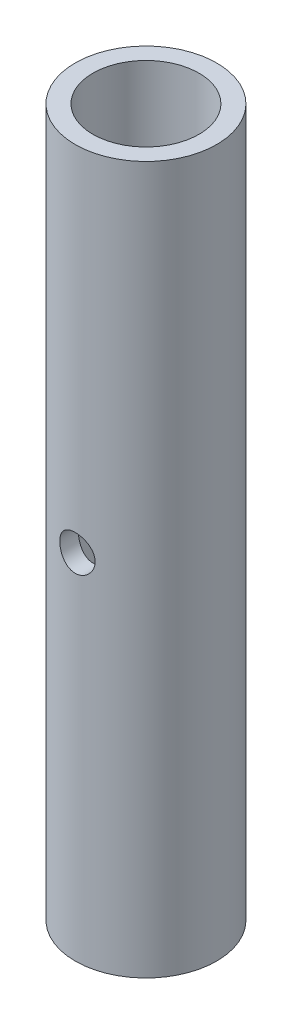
ISO-10303-21;
HEADER;
FILE_DESCRIPTION(('STEP AP214'),'2;1');
FILE_NAME('part.step','',(''),(''),'','','');
FILE_SCHEMA(('AUTOMOTIVE_DESIGN { 1 0 10303 214 1 1 1 1 }'));
ENDSEC;
DATA;
#1=APPLICATION_CONTEXT('core data for automotive mechanical design processes');
#2=APPLICATION_PROTOCOL_DEFINITION('international standard','automotive_design',2000,#1);
#3=PRODUCT_CONTEXT('',#1,'mechanical');
#4=PRODUCT('Part','Part','',(#3));
#5=PRODUCT_RELATED_PRODUCT_CATEGORY('part','',(#4));
#6=PRODUCT_DEFINITION_FORMATION('','',#4);
#7=PRODUCT_DEFINITION_CONTEXT('part definition',#1,'design');
#8=PRODUCT_DEFINITION('design','',#6,#7);
#9=PRODUCT_DEFINITION_SHAPE('','',#8);
#10=(LENGTH_UNIT() NAMED_UNIT(*) SI_UNIT(.MILLI.,.METRE.));
#11=(NAMED_UNIT(*) PLANE_ANGLE_UNIT() SI_UNIT($,.RADIAN.));
#12=(NAMED_UNIT(*) SI_UNIT($,.STERADIAN.) SOLID_ANGLE_UNIT());
#13=UNCERTAINTY_MEASURE_WITH_UNIT(LENGTH_MEASURE(1.E-05),#10,'distance_accuracy_value','');
#14=(GEOMETRIC_REPRESENTATION_CONTEXT(3) GLOBAL_UNCERTAINTY_ASSIGNED_CONTEXT((#13)) GLOBAL_UNIT_ASSIGNED_CONTEXT((#10,
#11,#12)) REPRESENTATION_CONTEXT('',''));
#15=CARTESIAN_POINT('',(0.,0.,0.));
#16=DIRECTION('',(0.,0.,1.));
#17=DIRECTION('',(1.,0.,0.));
#18=AXIS2_PLACEMENT_3D('',#15,#16,#17);
#19=CARTESIAN_POINT('',(0.,254.,0.));
#20=DIRECTION('',(0.,1.,0.));
#21=DIRECTION('',(0.,0.,1.));
#22=AXIS2_PLACEMENT_3D('',#19,#20,#21);
#23=PLANE('',#22);
#24=CARTESIAN_POINT('',(0.,254.,0.));
#25=DIRECTION('',(0.,1.,0.));
#26=DIRECTION('',(0.,0.,1.));
#27=AXIS2_PLACEMENT_3D('',#24,#25,#26);
#28=CIRCLE('',#27,25.4);
#29=CARTESIAN_POINT('',(0.,254.,25.4));
#30=VERTEX_POINT('',#29);
#31=EDGE_CURVE('E10',#30,#30,#28,.T.);
#32=ORIENTED_EDGE('',*,*,#31,.T.);
#33=EDGE_LOOP('',(#32));
#34=FACE_BOUND('',#33,.T.);
#35=CARTESIAN_POINT('',(0.,254.,0.));
#36=DIRECTION('',(0.,1.,0.));
#37=DIRECTION('',(0.,0.,1.));
#38=AXIS2_PLACEMENT_3D('',#35,#36,#37);
#39=CIRCLE('',#38,19.05);
#40=CARTESIAN_POINT('',(0.,254.,19.05));
#41=VERTEX_POINT('',#40);
#42=EDGE_CURVE('E65',#41,#41,#39,.T.);
#43=ORIENTED_EDGE('',*,*,#42,.F.);
#44=EDGE_LOOP('',(#43));
#45=FACE_BOUND('',#44,.T.);
#46=ADVANCED_FACE('F42',(#34,#45),#23,.T.);
#47=CARTESIAN_POINT('',(0.,0.,0.));
#48=DIRECTION('',(0.,1.,0.));
#49=DIRECTION('',(0.,0.,1.));
#50=AXIS2_PLACEMENT_3D('',#47,#48,#49);
#51=PLANE('',#50);
#52=CARTESIAN_POINT('',(0.,0.,0.));
#53=DIRECTION('',(0.,1.,0.));
#54=DIRECTION('',(0.,0.,1.));
#55=AXIS2_PLACEMENT_3D('',#52,#53,#54);
#56=CIRCLE('',#55,25.4);
#57=CARTESIAN_POINT('',(0.,0.,25.4));
#58=VERTEX_POINT('',#57);
#59=EDGE_CURVE('E57',#58,#58,#56,.T.);
#60=ORIENTED_EDGE('',*,*,#59,.F.);
#61=EDGE_LOOP('',(#60));
#62=FACE_BOUND('',#61,.T.);
#63=CARTESIAN_POINT('',(0.,0.,0.));
#64=DIRECTION('',(0.,1.,0.));
#65=DIRECTION('',(0.,0.,1.));
#66=AXIS2_PLACEMENT_3D('',#63,#64,#65);
#67=CIRCLE('',#66,19.05);
#68=CARTESIAN_POINT('',(0.,0.,19.05));
#69=VERTEX_POINT('',#68);
#70=EDGE_CURVE('E68',#69,#69,#67,.T.);
#71=ORIENTED_EDGE('',*,*,#70,.T.);
#72=EDGE_LOOP('',(#71));
#73=FACE_BOUND('',#72,.T.);
#74=ADVANCED_FACE('F108',(#62,#73),#51,.F.);
#75=CARTESIAN_POINT('',(0.,254.,0.));
#76=DIRECTION('',(0.,-1.,0.));
#77=DIRECTION('',(0.,0.,-1.));
#78=AXIS2_PLACEMENT_3D('',#75,#76,#77);
#79=CYLINDRICAL_SURFACE('',#78,25.4);
#80=CARTESIAN_POINT('',(0.,133.35,-25.4));
#81=CARTESIAN_POINT('',(-0.175477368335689,133.350005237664,-25.4000031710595));
#82=CARTESIAN_POINT('',(-0.350897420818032,133.342725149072,-25.3981788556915));
#83=CARTESIAN_POINT('',(-0.700509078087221,133.313678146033,-25.3909395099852));
#84=CARTESIAN_POINT('',(-0.874700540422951,133.291909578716,-25.3855240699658));
#85=CARTESIAN_POINT('',(-1.22059137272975,133.234053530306,-25.3712464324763));
#86=CARTESIAN_POINT('',(-1.39228995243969,133.197961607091,-25.3623831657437));
#87=CARTESIAN_POINT('',(-1.7319942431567,133.111743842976,-25.3414514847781));
#88=CARTESIAN_POINT('',(-1.89999856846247,133.061612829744,-25.3293818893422));
#89=CARTESIAN_POINT('',(-2.23081734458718,132.947815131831,-25.3023903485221));
#90=CARTESIAN_POINT('',(-2.39363964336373,132.884170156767,-25.2874729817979));
#91=CARTESIAN_POINT('',(-2.71334043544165,132.743759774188,-25.2551699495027));
#92=CARTESIAN_POINT('',(-2.87021670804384,132.666989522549,-25.2377833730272));
#93=CARTESIAN_POINT('',(-3.17688024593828,132.500938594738,-25.2010173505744));
#94=CARTESIAN_POINT('',(-3.32667006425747,132.411662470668,-25.1816386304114));
#95=CARTESIAN_POINT('',(-3.61832024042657,132.221169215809,-25.141388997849));
#96=CARTESIAN_POINT('',(-3.76017758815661,132.1199475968,-25.1205175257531));
#97=CARTESIAN_POINT('',(-4.03750393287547,131.904331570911,-25.0774522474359));
#98=CARTESIAN_POINT('',(-4.17281051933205,131.789731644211,-25.0552413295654));
#99=CARTESIAN_POINT('',(-4.43338729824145,131.549613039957,-25.010449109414));
#100=CARTESIAN_POINT('',(-4.55865374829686,131.42409032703,-24.9878676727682));
#101=CARTESIAN_POINT('',(-4.79824509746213,131.163018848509,-24.942968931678));
#102=CARTESIAN_POINT('',(-4.91257275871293,131.027472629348,-24.9206515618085));
#103=CARTESIAN_POINT('',(-5.12959684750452,130.747154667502,-24.8768868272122));
#104=CARTESIAN_POINT('',(-5.23228896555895,130.602379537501,-24.8554397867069));
#105=CARTESIAN_POINT('',(-5.4266843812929,130.302422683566,-24.8137286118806));
#106=CARTESIAN_POINT('',(-5.5182063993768,130.147120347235,-24.7934861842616));
#107=CARTESIAN_POINT('',(-5.68784421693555,129.829034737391,-24.755120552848));
#108=CARTESIAN_POINT('',(-5.76595494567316,129.666248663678,-24.7369981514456));
#109=CARTESIAN_POINT('',(-5.90808039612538,129.33444117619,-24.7034397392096));
#110=CARTESIAN_POINT('',(-5.97210210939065,129.16542290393,-24.68800239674));
#111=CARTESIAN_POINT('',(-6.08558870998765,128.822319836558,-24.6602710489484));
#112=CARTESIAN_POINT('',(-6.13504838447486,128.648233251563,-24.6479781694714));
#113=CARTESIAN_POINT('',(-6.25914374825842,128.127313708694,-24.6168789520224));
#114=CARTESIAN_POINT('',(-6.31252426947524,127.774717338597,-24.6031101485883));
#115=CARTESIAN_POINT('',(-6.34783939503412,127.243259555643,-24.5940009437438));
#116=CARTESIAN_POINT('',(-6.35214485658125,127.065610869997,-24.5928903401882));
#117=CARTESIAN_POINT('',(-6.3458827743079,126.710571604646,-24.5945073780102));
#118=CARTESIAN_POINT('',(-6.33531508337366,126.533181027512,-24.5972350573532));
#119=CARTESIAN_POINT('',(-6.28221071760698,126.012071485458,-24.6108806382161));
#120=CARTESIAN_POINT('',(-6.2188446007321,125.670381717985,-24.6271165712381));
#121=CARTESIAN_POINT('',(-6.03768209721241,125.002825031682,-24.6721486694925));
#122=CARTESIAN_POINT('',(-5.9198818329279,124.676959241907,-24.7009457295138));
#123=CARTESIAN_POINT('',(-5.6319822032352,124.046256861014,-24.7681803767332));
#124=CARTESIAN_POINT('',(-5.46136691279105,123.741665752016,-24.8067123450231));
#125=CARTESIAN_POINT('',(-5.07304154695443,123.164940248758,-24.8890242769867));
#126=CARTESIAN_POINT('',(-4.85532323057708,122.892811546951,-24.9328051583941));
#127=CARTESIAN_POINT('',(-4.37160850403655,122.380572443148,-25.0222123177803));
#128=CARTESIAN_POINT('',(-4.1044124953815,122.141596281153,-25.0678556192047));
#129=CARTESIAN_POINT('',(-3.53319044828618,121.711629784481,-25.1547191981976));
#130=CARTESIAN_POINT('',(-3.2291632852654,121.520640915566,-25.1959393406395));
#131=CARTESIAN_POINT('',(-2.59129059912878,121.191652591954,-25.2695173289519));
#132=CARTESIAN_POINT('',(-2.25734624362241,121.053837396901,-25.3018442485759));
#133=CARTESIAN_POINT('',(-1.57004175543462,120.836616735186,-25.3537684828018));
#134=CARTESIAN_POINT('',(-1.216685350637,120.757200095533,-25.3733682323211));
#135=CARTESIAN_POINT('',(-0.510285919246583,120.660762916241,-25.3972694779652));
#136=CARTESIAN_POINT('',(-0.157466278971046,120.642197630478,-25.4019496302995));
#137=CARTESIAN_POINT('',(0.546239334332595,120.663754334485,-25.3965627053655));
#138=CARTESIAN_POINT('',(0.897125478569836,120.703871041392,-25.3864969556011));
#139=CARTESIAN_POINT('',(1.58163313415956,120.840376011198,-25.3529923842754));
#140=CARTESIAN_POINT('',(1.91543343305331,120.935921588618,-25.3297539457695));
#141=CARTESIAN_POINT('',(2.56225810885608,121.179623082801,-25.2725214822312));
#142=CARTESIAN_POINT('',(2.8752803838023,121.327784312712,-25.2385263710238));
#143=CARTESIAN_POINT('',(3.47777277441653,121.675454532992,-25.1626516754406));
#144=CARTESIAN_POINT('',(3.76672640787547,121.875828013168,-25.1206428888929));
#145=CARTESIAN_POINT('',(4.30756129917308,122.321321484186,-25.0335780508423));
#146=CARTESIAN_POINT('',(4.55943614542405,122.566449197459,-24.9885214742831));
#147=CARTESIAN_POINT('',(4.90717834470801,122.965841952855,-24.9217589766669));
#148=CARTESIAN_POINT('',(5.01926866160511,123.106194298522,-24.8993709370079));
#149=CARTESIAN_POINT('',(5.23122685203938,123.395983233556,-24.8557025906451));
#150=CARTESIAN_POINT('',(5.33109917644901,123.545416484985,-24.8344218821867));
#151=CARTESIAN_POINT('',(5.51793758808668,123.85243225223,-24.7935782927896));
#152=CARTESIAN_POINT('',(5.60489898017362,124.010017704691,-24.7740160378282));
#153=CARTESIAN_POINT('',(5.76519514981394,124.332159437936,-24.7372045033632));
#154=CARTESIAN_POINT('',(5.83853539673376,124.496712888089,-24.7199542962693));
#155=CARTESIAN_POINT('',(5.97067425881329,124.830753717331,-24.688370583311));
#156=CARTESIAN_POINT('',(6.02955222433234,125.000208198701,-24.6740212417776));
#157=CARTESIAN_POINT('',(6.13279311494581,125.343652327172,-24.6485634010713));
#158=CARTESIAN_POINT('',(6.17716162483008,125.517640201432,-24.6374536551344));
#159=CARTESIAN_POINT('',(6.25103277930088,125.86893601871,-24.6188148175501));
#160=CARTESIAN_POINT('',(6.2805352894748,126.046243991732,-24.611285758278));
#161=CARTESIAN_POINT('',(6.32441063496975,126.402840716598,-24.6000476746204));
#162=CARTESIAN_POINT('',(6.33878385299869,126.582129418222,-24.5963385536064));
#163=CARTESIAN_POINT('',(6.35207673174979,126.93611907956,-24.5929088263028));
#164=CARTESIAN_POINT('',(6.35143127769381,127.110802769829,-24.5930759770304));
#165=CARTESIAN_POINT('',(6.33575561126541,127.459538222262,-24.5971190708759));
#166=CARTESIAN_POINT('',(6.32072072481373,127.633589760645,-24.600996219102));
#167=CARTESIAN_POINT('',(6.27639249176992,127.979710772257,-24.6123428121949));
#168=CARTESIAN_POINT('',(6.24710205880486,128.151780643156,-24.6198115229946));
#169=CARTESIAN_POINT('',(6.17450899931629,128.492756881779,-24.6381175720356));
#170=CARTESIAN_POINT('',(6.13120615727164,128.661663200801,-24.6489549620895));
#171=CARTESIAN_POINT('',(6.03123267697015,128.994165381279,-24.6736066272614));
#172=CARTESIAN_POINT('',(5.97464151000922,129.157786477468,-24.6874031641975));
#173=CARTESIAN_POINT('',(5.84841340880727,129.479602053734,-24.7176104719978));
#174=CARTESIAN_POINT('',(5.77878072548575,129.63779828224,-24.7340203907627));
#175=CARTESIAN_POINT('',(5.62693434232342,129.947867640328,-24.7690064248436));
#176=CARTESIAN_POINT('',(5.54471511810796,130.099737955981,-24.7875834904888));
#177=CARTESIAN_POINT('',(5.36832253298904,130.396076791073,-24.8263823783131));
#178=CARTESIAN_POINT('',(5.27415309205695,130.540547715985,-24.84660366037));
#179=CARTESIAN_POINT('',(5.07182215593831,130.824967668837,-24.888703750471));
#180=CARTESIAN_POINT('',(4.96335638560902,130.964695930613,-24.9106122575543));
#181=CARTESIAN_POINT('',(4.73524098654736,131.234524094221,-24.9549791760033));
#182=CARTESIAN_POINT('',(4.61559517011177,131.364627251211,-24.9774373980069));
#183=CARTESIAN_POINT('',(4.3657987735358,131.614490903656,-25.0223082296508));
#184=CARTESIAN_POINT('',(4.23564203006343,131.734245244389,-25.0447208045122));
#185=CARTESIAN_POINT('',(3.9657779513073,131.962491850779,-25.0888678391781));
#186=CARTESIAN_POINT('',(3.82607410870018,132.070988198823,-25.1106025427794));
#187=CARTESIAN_POINT('',(3.53530097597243,132.277932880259,-25.153203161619));
#188=CARTESIAN_POINT('',(3.38406902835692,132.376157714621,-25.1740455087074));
#189=CARTESIAN_POINT('',(3.073671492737,132.559453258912,-25.2138259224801));
#190=CARTESIAN_POINT('',(2.91450885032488,132.644528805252,-25.232764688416));
#191=CARTESIAN_POINT('',(2.58935741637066,132.800883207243,-25.2682002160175));
#192=CARTESIAN_POINT('',(2.42337160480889,132.872168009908,-25.2846980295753));
#193=CARTESIAN_POINT('',(2.08575276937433,133.000396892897,-25.3147861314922));
#194=CARTESIAN_POINT('',(1.91412060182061,133.057343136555,-25.3283768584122));
#195=CARTESIAN_POINT('',(1.45814658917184,133.187263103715,-25.3596827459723));
#196=CARTESIAN_POINT('',(1.17008430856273,133.248183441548,-25.3747073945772));
#197=CARTESIAN_POINT('',(0.587960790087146,133.32954598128,-25.3948629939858));
#198=CARTESIAN_POINT('',(0.293900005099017,133.349991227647,-25.3999946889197));
#199=CARTESIAN_POINT('',(0.,133.35,-25.4));
#200=B_SPLINE_CURVE_WITH_KNOTS('',3,(#80,#81,#82,#83,#84,#85,#86,#87,#88,#89,#90,#91,#92,#93,
#94,#95,#96,#97,#98,#99,#100,#101,#102,#103,#104,#105,#106,#107,#108,#109,#110,#111,#112,#113,
#114,#115,#116,#117,#118,#119,#120,#121,#122,#123,#124,#125,#126,#127,#128,#129,#130,#131,#132,
#133,#134,#135,#136,#137,#138,#139,#140,#141,#142,#143,#144,#145,#146,#147,#148,#149,#150,#151,
#152,#153,#154,#155,#156,#157,#158,#159,#160,#161,#162,#163,#164,#165,#166,#167,#168,#169,#170,
#171,#172,#173,#174,#175,#176,#177,#178,#179,#180,#181,#182,#183,#184,#185,#186,#187,#188,#189,
#190,#191,#192,#193,#194,#195,#196,#197,#198,#199),.UNSPECIFIED.,.T.,.F.,(4,2,2,2,2,2,2,2,2,2,2,
2,2,2,2,2,2,2,2,2,2,2,2,2,2,2,2,2,2,2,2,2,2,2,2,2,2,2,2,2,2,2,2,2,2,2,2,2,2,2,2,2,2,2,2,2,2,2,2,
4),(0.,0.526173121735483,1.05240628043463,1.57880276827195,2.10539344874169,2.63114449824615,
3.15709000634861,3.682844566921,4.20879729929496,4.74428380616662,5.27996899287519,
5.81551855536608,6.35126582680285,6.89479488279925,7.43852899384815,7.98199267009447,
8.52565065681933,9.58998829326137,10.1225673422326,10.6551516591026,11.6935230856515,
12.7319684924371,13.780896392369,14.8300079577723,15.9090342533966,16.9880935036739,
18.0708590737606,19.1534174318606,20.2082724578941,21.2630325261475,22.302162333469,
23.3413971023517,24.3990725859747,25.4569307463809,25.9994251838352,26.5417214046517,
27.0842143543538,27.6264890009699,28.1657183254,28.7047398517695,29.2437662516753,
29.7827790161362,30.3062039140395,30.8297988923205,31.3532869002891,31.8767829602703,
32.397224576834,32.9174968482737,33.4379981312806,33.9583291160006,34.4924266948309,
35.0263428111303,35.5605743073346,36.0946113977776,36.6385463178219,37.1822806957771,
37.725780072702,38.2691973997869,39.150529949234,40.0317962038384),.UNSPECIFIED.);
#201=CARTESIAN_POINT('',(0.,133.35,-25.4));
#202=VERTEX_POINT('',#201);
#203=EDGE_CURVE('E95',#202,#202,#200,.T.);
#204=ORIENTED_EDGE('',*,*,#203,.T.);
#205=EDGE_LOOP('',(#204));
#206=FACE_BOUND('',#205,.T.);
#207=CARTESIAN_POINT('',(6.35000000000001,127.,24.5934442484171));
#208=CARTESIAN_POINT('',(6.35000528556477,126.824619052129,24.5934406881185));
#209=CARTESIAN_POINT('',(6.34273309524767,126.649295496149,24.5953234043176));
#210=CARTESIAN_POINT('',(6.31371849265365,126.299879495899,24.6027886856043));
#211=CARTESIAN_POINT('',(6.29197442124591,126.125787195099,24.6083716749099));
#212=CARTESIAN_POINT('',(6.23418528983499,125.780096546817,24.6230748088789));
#213=CARTESIAN_POINT('',(6.19813561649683,125.608499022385,24.6321960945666));
#214=CARTESIAN_POINT('',(6.11202207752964,125.268999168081,24.6537047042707));
#215=CARTESIAN_POINT('',(6.06195302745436,125.101098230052,24.6660932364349));
#216=CARTESIAN_POINT('',(5.94830490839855,124.770499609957,24.6937457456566));
#217=CARTESIAN_POINT('',(5.88474877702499,124.60779362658,24.7090048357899));
#218=CARTESIAN_POINT('',(5.74453765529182,124.288315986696,24.7419779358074));
#219=CARTESIAN_POINT('',(5.66787782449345,124.131546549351,24.7596928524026));
#220=CARTESIAN_POINT('',(5.50206487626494,123.825078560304,24.7970663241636));
#221=CARTESIAN_POINT('',(5.41291620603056,123.675377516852,24.8167241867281));
#222=CARTESIAN_POINT('',(5.22268993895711,123.383881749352,24.8574530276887));
#223=CARTESIAN_POINT('',(5.12160785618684,123.242090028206,24.8785245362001));
#224=CARTESIAN_POINT('',(4.90613414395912,122.96468202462,24.9219211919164));
#225=CARTESIAN_POINT('',(4.79152157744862,122.829239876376,24.9442627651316));
#226=CARTESIAN_POINT('',(4.55134895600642,122.568390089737,24.9892006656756));
#227=CARTESIAN_POINT('',(4.42578485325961,122.44298619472,25.0117970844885));
#228=CARTESIAN_POINT('',(4.16460304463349,122.203125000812,25.0566084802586));
#229=CARTESIAN_POINT('',(4.0289880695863,122.088664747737,25.0788235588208));
#230=CARTESIAN_POINT('',(3.7485044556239,121.871384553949,25.1222781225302));
#231=CARTESIAN_POINT('',(3.60363242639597,121.768568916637,25.1435172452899));
#232=CARTESIAN_POINT('',(3.30356479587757,121.574009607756,25.1847117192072));
#233=CARTESIAN_POINT('',(3.14825423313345,121.482438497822,25.2046452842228));
#234=CARTESIAN_POINT('',(2.83020069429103,121.31273768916,25.2423375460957));
#235=CARTESIAN_POINT('',(2.66745772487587,121.234607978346,25.2600962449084));
#236=CARTESIAN_POINT('',(2.33569777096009,121.092413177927,25.2929297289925));
#237=CARTESIAN_POINT('',(2.16668153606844,121.028346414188,25.3080048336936));
#238=CARTESIAN_POINT('',(1.82357341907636,120.914793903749,25.3350387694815));
#239=CARTESIAN_POINT('',(1.64948153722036,120.865308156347,25.3469976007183));
#240=CARTESIAN_POINT('',(1.30111425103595,120.782202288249,25.3672410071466));
#241=CARTESIAN_POINT('',(1.12691535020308,120.748278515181,25.3755956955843));
#242=CARTESIAN_POINT('',(0.776098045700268,120.69510808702,25.3887474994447));
#243=CARTESIAN_POINT('',(0.599478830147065,120.675866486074,25.3935433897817));
#244=CARTESIAN_POINT('',(0.245262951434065,120.652258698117,25.3994326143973));
#245=CARTESIAN_POINT('',(0.0676668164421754,120.647885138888,25.4005277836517));
#246=CARTESIAN_POINT('',(-0.287270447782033,120.65401365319,25.3989975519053));
#247=CARTESIAN_POINT('',(-0.464611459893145,120.66452117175,25.3963707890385));
#248=CARTESIAN_POINT('',(-0.986274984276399,120.717502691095,25.3831796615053));
#249=CARTESIAN_POINT('',(-1.32859320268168,120.780902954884,25.3674351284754));
#250=CARTESIAN_POINT('',(-1.99737464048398,120.962346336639,25.3235693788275));
#251=CARTESIAN_POINT('',(-2.32383701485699,121.080392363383,25.2954475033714));
#252=CARTESIAN_POINT('',(-2.9553171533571,121.368826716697,25.2295021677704));
#253=CARTESIAN_POINT('',(-3.26011450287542,121.539678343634,25.1915933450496));
#254=CARTESIAN_POINT('',(-3.83715433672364,121.928523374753,25.1101837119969));
#255=CARTESIAN_POINT('',(-4.1093911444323,122.146524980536,25.0666819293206));
#256=CARTESIAN_POINT('',(-4.62136397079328,122.630460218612,24.9774382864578));
#257=CARTESIAN_POINT('',(-4.86002095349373,122.89753143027,24.9316676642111));
#258=CARTESIAN_POINT('',(-5.28940029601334,123.468383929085,24.8441221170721));
#259=CARTESIAN_POINT('',(-5.48012041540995,123.772166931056,24.8023473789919));
#260=CARTESIAN_POINT('',(-5.80890453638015,124.409936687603,24.7274206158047));
#261=CARTESIAN_POINT('',(-5.94670872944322,124.7440627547,24.6943113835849));
#262=CARTESIAN_POINT('',(-6.1638537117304,125.431767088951,24.6410134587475));
#263=CARTESIAN_POINT('',(-6.24320701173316,125.785341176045,24.6208220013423));
#264=CARTESIAN_POINT('',(-6.33940728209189,126.491897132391,24.5962260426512));
#265=CARTESIAN_POINT('',(-6.35784982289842,126.84464798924,24.5914186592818));
#266=CARTESIAN_POINT('',(-6.33607313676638,127.548187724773,24.5970385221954));
#267=CARTESIAN_POINT('',(-6.29585930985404,127.89897678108,24.6074643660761));
#268=CARTESIAN_POINT('',(-6.15931075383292,128.582710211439,24.6419898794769));
#269=CARTESIAN_POINT('',(-6.06390501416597,128.915852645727,24.6658630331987));
#270=CARTESIAN_POINT('',(-5.82070964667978,129.561415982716,24.7243782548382));
#271=CARTESIAN_POINT('',(-5.67291381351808,129.873834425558,24.7590215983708));
#272=CARTESIAN_POINT('',(-5.32579856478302,130.475840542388,24.8360218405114));
#273=CARTESIAN_POINT('',(-5.12552527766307,130.76486011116,24.8785167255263));
#274=CARTESIAN_POINT('',(-4.68032883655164,131.305779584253,24.9660940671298));
#275=CARTESIAN_POINT('',(-4.435398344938,131.557673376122,25.0111769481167));
#276=CARTESIAN_POINT('',(-3.90058368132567,132.023635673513,25.1002134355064));
#277=CARTESIAN_POINT('',(-3.60972805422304,132.236600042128,25.1441105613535));
#278=CARTESIAN_POINT('',(-2.99525388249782,132.61071361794,25.2246715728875));
#279=CARTESIAN_POINT('',(-2.67163704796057,132.771865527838,25.2613358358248));
#280=CARTESIAN_POINT('',(-2.17011561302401,132.970367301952,25.3076823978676));
#281=CARTESIAN_POINT('',(-2.00081638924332,133.029212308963,25.3216590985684));
#282=CARTESIAN_POINT('',(-1.65765281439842,133.132432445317,25.3464334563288));
#283=CARTESIAN_POINT('',(-1.48379021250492,133.176813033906,25.3572323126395));
#284=CARTESIAN_POINT('',(-1.13276160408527,133.25072318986,25.3753376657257));
#285=CARTESIAN_POINT('',(-0.955595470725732,133.280252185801,25.382644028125));
#286=CARTESIAN_POINT('',(-0.59928825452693,133.324204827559,25.3935544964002));
#287=CARTESIAN_POINT('',(-0.420147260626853,133.33862915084,25.3971587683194));
#288=CARTESIAN_POINT('',(-0.066111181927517,133.352059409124,25.4005141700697));
#289=CARTESIAN_POINT('',(0.108767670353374,133.351471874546,25.4003668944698));
#290=CARTESIAN_POINT('',(0.457838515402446,133.335882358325,25.3964731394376));
#291=CARTESIAN_POINT('',(0.632030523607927,133.320880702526,25.3927267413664));
#292=CARTESIAN_POINT('',(0.978500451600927,133.276586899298,25.381737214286));
#293=CARTESIAN_POINT('',(1.1507780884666,133.247292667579,25.3744935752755));
#294=CARTESIAN_POINT('',(1.49211023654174,133.174669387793,25.3567112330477));
#295=CARTESIAN_POINT('',(1.66116586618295,133.131345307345,25.3461736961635));
#296=CARTESIAN_POINT('',(1.99409594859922,133.031263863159,25.3221503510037));
#297=CARTESIAN_POINT('',(2.15799231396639,132.974575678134,25.3086797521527));
#298=CARTESIAN_POINT('',(2.48034111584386,132.848108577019,25.2791237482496));
#299=CARTESIAN_POINT('',(2.6387954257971,132.778334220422,25.2630392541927));
#300=CARTESIAN_POINT('',(2.9493579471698,132.626162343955,25.2286684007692));
#301=CARTESIAN_POINT('',(3.10146333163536,132.543759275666,25.2103810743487));
#302=CARTESIAN_POINT('',(3.39823934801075,132.366963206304,25.1720946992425));
#303=CARTESIAN_POINT('',(3.54291240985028,132.272574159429,25.1520962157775));
#304=CARTESIAN_POINT('',(3.82740113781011,132.069983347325,25.1103996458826));
#305=CARTESIAN_POINT('',(3.96701305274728,131.961501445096,25.0886720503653));
#306=CARTESIAN_POINT('',(4.23660272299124,131.733378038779,25.0445573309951));
#307=CARTESIAN_POINT('',(4.36658373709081,131.613740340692,25.0221704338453));
#308=CARTESIAN_POINT('',(4.61620195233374,131.363985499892,24.9773251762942));
#309=CARTESIAN_POINT('',(4.7358328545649,131.233862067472,24.95486678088));
#310=CARTESIAN_POINT('',(4.9638352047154,130.96409130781,24.9105163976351));
#311=CARTESIAN_POINT('',(5.07221071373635,130.824447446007,24.8886242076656));
#312=CARTESIAN_POINT('',(5.27897630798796,130.533741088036,24.8455987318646));
#313=CARTESIAN_POINT('',(5.37713643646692,130.382511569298,24.8244878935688));
#314=CARTESIAN_POINT('',(5.56030411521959,130.072129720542,24.7841040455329));
#315=CARTESIAN_POINT('',(5.64531649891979,129.912980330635,24.7648303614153));
#316=CARTESIAN_POINT('',(5.80154934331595,129.587861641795,24.7286971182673));
#317=CARTESIAN_POINT('',(5.87277587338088,129.421895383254,24.7118364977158));
#318=CARTESIAN_POINT('',(6.00089532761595,129.084315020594,24.6810367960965));
#319=CARTESIAN_POINT('',(6.05779043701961,128.912701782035,24.6670972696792));
#320=CARTESIAN_POINT('',(6.18752575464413,128.45697875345,24.6349649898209));
#321=CARTESIAN_POINT('',(6.24834660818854,128.169153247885,24.6195019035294));
#322=CARTESIAN_POINT('',(6.32957758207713,127.587497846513,24.598744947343));
#323=CARTESIAN_POINT('',(6.34999114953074,127.293668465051,24.5934502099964));
#324=CARTESIAN_POINT('',(6.35000000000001,127.,24.5934442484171));
#325=B_SPLINE_CURVE_WITH_KNOTS('',3,(#207,#208,#209,#210,#211,#212,#213,#214,#215,#216,#217,
#218,#219,#220,#221,#222,#223,#224,#225,#226,#227,#228,#229,#230,#231,#232,#233,#234,#235,#236,
#237,#238,#239,#240,#241,#242,#243,#244,#245,#246,#247,#248,#249,#250,#251,#252,#253,#254,#255,
#256,#257,#258,#259,#260,#261,#262,#263,#264,#265,#266,#267,#268,#269,#270,#271,#272,#273,#274,
#275,#276,#277,#278,#279,#280,#281,#282,#283,#284,#285,#286,#287,#288,#289,#290,#291,#292,#293,
#294,#295,#296,#297,#298,#299,#300,#301,#302,#303,#304,#305,#306,#307,#308,#309,#310,#311,#312,
#313,#314,#315,#316,#317,#318,#319,#320,#321,#322,#323,#324),.UNSPECIFIED.,.T.,.F.,(4,2,2,2,2,2,
2,2,2,2,2,2,2,2,2,2,2,2,2,2,2,2,2,2,2,2,2,2,2,2,2,2,2,2,2,2,2,2,2,2,2,2,2,2,2,2,2,2,2,2,2,2,2,2,
2,2,2,2,4),(0.,0.52588339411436,1.05182708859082,1.577940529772,2.1042487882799,
2.62966902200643,3.15528376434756,3.68071181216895,4.20633800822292,4.7422047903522,
5.27827048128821,5.81419105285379,6.35030903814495,6.8938327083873,7.43735588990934,
7.98081433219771,8.5242727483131,9.05662154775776,9.58915351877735,10.1214213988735,
10.6538840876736,11.6940169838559,12.7342052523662,13.7837921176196,14.8335617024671,
15.9117429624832,16.9899746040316,18.0734344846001,19.1566623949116,20.2112799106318,
21.2658003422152,22.3030671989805,23.3404569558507,24.3981973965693,25.4561117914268,
26.5404965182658,27.6248246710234,28.1636112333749,28.7021942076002,29.2407979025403,
29.779377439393,30.3033877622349,30.8273862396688,31.3514611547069,31.8753507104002,
32.396585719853,32.9176394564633,33.4389227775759,33.9600345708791,34.4938220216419,
35.0274280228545,35.5613565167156,36.0950916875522,36.6390098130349,37.1827275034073,
37.7262052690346,38.2696001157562,39.1502462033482,40.0308171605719),.UNSPECIFIED.);
#326=CARTESIAN_POINT('',(6.35000000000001,127.,24.5934442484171));
#327=VERTEX_POINT('',#326);
#328=EDGE_CURVE('E89',#327,#327,#325,.T.);
#329=ORIENTED_EDGE('',*,*,#328,.T.);
#330=EDGE_LOOP('',(#329));
#331=FACE_BOUND('',#330,.T.);
#332=ORIENTED_EDGE('',*,*,#31,.F.);
#333=EDGE_LOOP('',(#332));
#334=FACE_BOUND('',#333,.T.);
#335=ORIENTED_EDGE('',*,*,#59,.T.);
#336=EDGE_LOOP('',(#335));
#337=FACE_BOUND('',#336,.T.);
#338=ADVANCED_FACE('F44',(#206,#331,#334,#337),#79,.T.);
#339=CARTESIAN_POINT('',(0.,254.,0.));
#340=DIRECTION('',(0.,-1.,0.));
#341=DIRECTION('',(0.,0.,-1.));
#342=AXIS2_PLACEMENT_3D('',#339,#340,#341);
#343=CYLINDRICAL_SURFACE('',#342,19.05);
#344=CARTESIAN_POINT('',(0.,133.35,-19.05));
#345=CARTESIAN_POINT('',(-0.173206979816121,133.350000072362,-19.0500000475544));
#346=CARTESIAN_POINT('',(-0.346412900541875,133.34290756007,-19.0476323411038));
#347=CARTESIAN_POINT('',(-0.691601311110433,133.314601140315,-19.0382249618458));
#348=CARTESIAN_POINT('',(-0.863583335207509,133.293382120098,-19.0311835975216));
#349=CARTESIAN_POINT('',(-1.20495064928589,133.237027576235,-19.0126222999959));
#350=CARTESIAN_POINT('',(-1.3743366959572,133.201896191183,-19.0011036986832));
#351=CARTESIAN_POINT('',(-1.70942803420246,133.118022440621,-18.9738932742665));
#352=CARTESIAN_POINT('',(-1.87513187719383,133.069274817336,-18.9581998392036));
#353=CARTESIAN_POINT('',(-2.20132105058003,132.958714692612,-18.9230954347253));
#354=CARTESIAN_POINT('',(-2.36181656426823,132.896929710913,-18.9036923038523));
#355=CARTESIAN_POINT('',(-2.67697294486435,132.760711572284,-18.861643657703));
#356=CARTESIAN_POINT('',(-2.83163162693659,132.686273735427,-18.8389969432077));
#357=CARTESIAN_POINT('',(-3.1340689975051,132.525345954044,-18.7910497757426));
#358=CARTESIAN_POINT('',(-3.28184910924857,132.438858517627,-18.7657498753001));
#359=CARTESIAN_POINT('',(-3.56974509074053,132.254394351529,-18.7131195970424));
#360=CARTESIAN_POINT('',(-3.70985818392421,132.156413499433,-18.6857884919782));
#361=CARTESIAN_POINT('',(-3.98578637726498,131.946411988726,-18.6289146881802));
#362=CARTESIAN_POINT('',(-4.12133296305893,131.834049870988,-18.5993296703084));
#363=CARTESIAN_POINT('',(-4.38255929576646,131.598543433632,-18.5395154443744));
#364=CARTESIAN_POINT('',(-4.50823882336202,131.475398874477,-18.5092862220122));
#365=CARTESIAN_POINT('',(-4.74901553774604,131.219038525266,-18.4489772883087));
#366=CARTESIAN_POINT('',(-4.86410864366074,131.085818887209,-18.4188976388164));
#367=CARTESIAN_POINT('',(-5.08289666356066,130.810198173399,-18.3597250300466));
#368=CARTESIAN_POINT('',(-5.18659547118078,130.667800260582,-18.3306317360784));
#369=CARTESIAN_POINT('',(-5.38480736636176,130.370343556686,-18.2734042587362));
#370=CARTESIAN_POINT('',(-5.47896348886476,130.215036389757,-18.2453229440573));
#371=CARTESIAN_POINT('',(-5.65376497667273,129.896621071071,-18.1919156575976));
#372=CARTESIAN_POINT('',(-5.73441567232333,129.733516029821,-18.1665886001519));
#373=CARTESIAN_POINT('',(-5.88159402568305,129.400519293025,-18.1194737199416));
#374=CARTESIAN_POINT('',(-5.94811917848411,129.230626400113,-18.0976865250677));
#375=CARTESIAN_POINT('',(-6.0663951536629,128.885372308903,-18.0583841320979));
#376=CARTESIAN_POINT('',(-6.11815270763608,128.710013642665,-18.0408669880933));
#377=CARTESIAN_POINT('',(-6.20495158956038,128.361002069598,-18.0111940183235));
#378=CARTESIAN_POINT('',(-6.24049221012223,128.1874868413,-17.9988790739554));
#379=CARTESIAN_POINT('',(-6.29696610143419,127.837886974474,-17.9791995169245));
#380=CARTESIAN_POINT('',(-6.31790546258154,127.661803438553,-17.9718328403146));
#381=CARTESIAN_POINT('',(-6.34498350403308,127.308373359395,-17.9622908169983));
#382=CARTESIAN_POINT('',(-6.35112320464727,127.13102690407,-17.960115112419));
#383=CARTESIAN_POINT('',(-6.34853982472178,126.776458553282,-17.9610285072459));
#384=CARTESIAN_POINT('',(-6.33981716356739,126.599236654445,-17.9641174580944));
#385=CARTESIAN_POINT('',(-6.30834384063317,126.254426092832,-17.9751928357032));
#386=CARTESIAN_POINT('',(-6.28625613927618,126.086768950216,-17.9829477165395));
#387=CARTESIAN_POINT('',(-6.22883516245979,125.753951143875,-18.0029174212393));
#388=CARTESIAN_POINT('',(-6.19349742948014,125.58879133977,-18.0151337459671));
#389=CARTESIAN_POINT('',(-6.10990376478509,125.262189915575,-18.0436560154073));
#390=CARTESIAN_POINT('',(-6.06165145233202,125.100747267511,-18.0599608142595));
#391=CARTESIAN_POINT('',(-5.95260759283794,124.782508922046,-18.0961946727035));
#392=CARTESIAN_POINT('',(-5.89181128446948,124.62571501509,-18.1161251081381));
#393=CARTESIAN_POINT('',(-5.75711105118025,124.315370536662,-18.1593846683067));
#394=CARTESIAN_POINT('',(-5.68301613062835,124.161909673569,-18.1827622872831));
#395=CARTESIAN_POINT('',(-5.52290717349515,123.861696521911,-18.2320325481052));
#396=CARTESIAN_POINT('',(-5.43688906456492,123.714946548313,-18.2579260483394));
#397=CARTESIAN_POINT('',(-5.25352969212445,123.429038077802,-18.3115276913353));
#398=CARTESIAN_POINT('',(-5.15618765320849,123.289880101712,-18.3392359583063));
#399=CARTESIAN_POINT('',(-4.95079561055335,123.019938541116,-18.3957458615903));
#400=CARTESIAN_POINT('',(-4.84274522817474,122.889155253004,-18.4245475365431));
#401=CARTESIAN_POINT('',(-4.61064072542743,122.630068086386,-18.4840358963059));
#402=CARTESIAN_POINT('',(-4.48604452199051,122.502253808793,-18.5147422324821));
#403=CARTESIAN_POINT('',(-4.22652342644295,122.257553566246,-18.575703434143));
#404=CARTESIAN_POINT('',(-4.09160180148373,122.140664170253,-18.6059584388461));
#405=CARTESIAN_POINT('',(-3.81215729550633,121.918481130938,-18.6652179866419));
#406=CARTESIAN_POINT('',(-3.66762987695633,121.813193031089,-18.6942219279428));
#407=CARTESIAN_POINT('',(-3.3699888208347,121.615055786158,-18.7501624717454));
#408=CARTESIAN_POINT('',(-3.21687861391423,121.522201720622,-18.777099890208));
#409=CARTESIAN_POINT('',(-2.90136608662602,121.348688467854,-18.8284460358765));
#410=CARTESIAN_POINT('',(-2.73888379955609,121.268165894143,-18.852825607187));
#411=CARTESIAN_POINT('',(-2.4072711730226,121.121188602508,-18.8980298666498));
#412=CARTESIAN_POINT('',(-2.23814344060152,121.054728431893,-18.9188559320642));
#413=CARTESIAN_POINT('',(-1.89440949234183,120.936441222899,-18.9563603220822));
#414=CARTESIAN_POINT('',(-1.71980372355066,120.884612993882,-18.9730389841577));
#415=CARTESIAN_POINT('',(-1.36642567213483,120.796085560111,-19.0017577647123));
#416=CARTESIAN_POINT('',(-1.18765358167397,120.759385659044,-19.0137980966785));
#417=CARTESIAN_POINT('',(-0.83517129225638,120.702742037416,-19.0324663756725));
#418=CARTESIAN_POINT('',(-0.6615777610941,120.682140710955,-19.0393063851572));
#419=CARTESIAN_POINT('',(-0.313163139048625,120.655320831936,-19.0482228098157));
#420=CARTESIAN_POINT('',(-0.138342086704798,120.649101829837,-19.0502993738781));
#421=CARTESIAN_POINT('',(0.21118069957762,120.651107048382,-19.0496310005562));
#422=CARTESIAN_POINT('',(0.385882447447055,120.659329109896,-19.0468867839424));
#423=CARTESIAN_POINT('',(0.73387345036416,120.690131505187,-19.0366548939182));
#424=CARTESIAN_POINT('',(0.907162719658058,120.712711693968,-19.0291672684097));
#425=CARTESIAN_POINT('',(1.2460160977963,120.771144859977,-19.0099421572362));
#426=CARTESIAN_POINT('',(1.41165802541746,120.806591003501,-18.9983351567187));
#427=CARTESIAN_POINT('',(1.73933064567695,120.890512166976,-18.9711429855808));
#428=CARTESIAN_POINT('',(1.90136011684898,120.938991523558,-18.9555564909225));
#429=CARTESIAN_POINT('',(2.22065102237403,121.048555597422,-18.9208084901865));
#430=CARTESIAN_POINT('',(2.37791372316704,121.109636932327,-18.9016479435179));
#431=CARTESIAN_POINT('',(2.68679846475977,121.24396059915,-18.8602202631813));
#432=CARTESIAN_POINT('',(2.83841834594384,121.317207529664,-18.8379519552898));
#433=CARTESIAN_POINT('',(3.13890847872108,121.47736597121,-18.7902499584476));
#434=CARTESIAN_POINT('',(3.28760543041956,121.564582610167,-18.7647491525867));
#435=CARTESIAN_POINT('',(3.57721512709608,121.750650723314,-18.7116999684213));
#436=CARTESIAN_POINT('',(3.71812516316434,121.849506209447,-18.6841508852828));
#437=CARTESIAN_POINT('',(3.99130640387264,122.058186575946,-18.6277060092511));
#438=CARTESIAN_POINT('',(4.12357677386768,122.168012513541,-18.5988100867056));
#439=CARTESIAN_POINT('',(4.37871059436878,122.397947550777,-18.5404024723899));
#440=CARTESIAN_POINT('',(4.50157379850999,122.518056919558,-18.5108907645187));
#441=CARTESIAN_POINT('',(4.74256806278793,122.773561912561,-18.4506550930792));
#442=CARTESIAN_POINT('',(4.86022661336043,122.909405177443,-18.4199373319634));
#443=CARTESIAN_POINT('',(5.08367167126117,123.19066527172,-18.3595255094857));
#444=CARTESIAN_POINT('',(5.1894621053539,123.336078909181,-18.3298311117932));
#445=CARTESIAN_POINT('',(5.38852533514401,123.635679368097,-18.2723024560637));
#446=CARTESIAN_POINT('',(5.48179286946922,123.789869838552,-18.2444689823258));
#447=CARTESIAN_POINT('',(5.65502039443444,124.105919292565,-18.1915213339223));
#448=CARTESIAN_POINT('',(5.73498592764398,124.267775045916,-18.1664060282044));
#449=CARTESIAN_POINT('',(5.88088643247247,124.597878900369,-18.119700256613));
#450=CARTESIAN_POINT('',(5.94684322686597,124.766116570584,-18.0981043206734));
#451=CARTESIAN_POINT('',(6.06427106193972,125.107973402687,-18.0590959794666));
#452=CARTESIAN_POINT('',(6.11574805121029,125.281590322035,-18.0416818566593));
#453=CARTESIAN_POINT('',(6.20374641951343,125.63295088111,-18.0116128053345));
#454=CARTESIAN_POINT('',(6.24027034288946,125.810693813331,-17.9989570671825));
#455=CARTESIAN_POINT('',(6.29799572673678,126.16893890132,-17.9788400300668));
#456=CARTESIAN_POINT('',(6.31919795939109,126.349440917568,-17.9713784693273));
#457=CARTESIAN_POINT('',(6.34536101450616,126.702385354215,-17.9621566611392));
#458=CARTESIAN_POINT('',(6.35110334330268,126.87476312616,-17.9601221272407));
#459=CARTESIAN_POINT('',(6.34854710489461,127.21946264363,-17.9610259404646));
#460=CARTESIAN_POINT('',(6.34024376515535,127.391784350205,-17.9639659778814));
#461=CARTESIAN_POINT('',(6.30967578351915,127.734952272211,-17.9747253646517));
#462=CARTESIAN_POINT('',(6.28741723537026,127.905799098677,-17.9825425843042));
#463=CARTESIAN_POINT('',(6.22914877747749,128.244915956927,-18.0028096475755));
#464=CARTESIAN_POINT('',(6.19313370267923,128.413184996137,-18.0152612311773));
#465=CARTESIAN_POINT('',(6.10851743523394,128.742665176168,-18.0441256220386));
#466=CARTESIAN_POINT('',(6.06017433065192,128.903949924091,-18.0604567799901));
#467=CARTESIAN_POINT('',(5.95097195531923,129.221866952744,-18.0967328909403));
#468=CARTESIAN_POINT('',(5.89010824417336,129.378497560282,-18.1166791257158));
#469=CARTESIAN_POINT('',(5.75635872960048,129.686066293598,-18.1596190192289));
#470=CARTESIAN_POINT('',(5.68347509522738,129.8370054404,-18.1826121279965));
#471=CARTESIAN_POINT('',(5.52617088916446,130.132402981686,-18.2310369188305));
#472=CARTESIAN_POINT('',(5.44174617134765,130.27685902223,-18.2564694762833));
#473=CARTESIAN_POINT('',(5.25802199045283,130.564559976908,-18.3102500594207));
#474=CARTESIAN_POINT('',(5.15823547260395,130.707479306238,-18.3386767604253));
#475=CARTESIAN_POINT('',(4.94738392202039,130.984494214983,-18.3966802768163));
#476=CARTESIAN_POINT('',(4.83631849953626,131.118589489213,-18.4262571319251));
#477=CARTESIAN_POINT('',(4.60355182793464,131.377224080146,-18.4857849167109));
#478=CARTESIAN_POINT('',(4.48184610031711,131.50175933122,-18.51573599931));
#479=CARTESIAN_POINT('',(4.22860900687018,131.740425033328,-18.5752059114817));
#480=CARTESIAN_POINT('',(4.09708086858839,131.854558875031,-18.6047248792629));
#481=CARTESIAN_POINT('',(3.81956162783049,132.07604123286,-18.6637175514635));
#482=CARTESIAN_POINT('',(3.67320473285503,132.182944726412,-18.693143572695));
#483=CARTESIAN_POINT('',(3.37165840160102,132.383980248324,-18.7498785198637));
#484=CARTESIAN_POINT('',(3.21647230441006,132.478117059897,-18.7771882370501));
#485=CARTESIAN_POINT('',(2.89820274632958,132.652954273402,-18.8289382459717));
#486=CARTESIAN_POINT('',(2.73511768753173,132.733651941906,-18.8533779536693));
#487=CARTESIAN_POINT('',(2.4022719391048,132.880874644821,-18.8986713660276));
#488=CARTESIAN_POINT('',(2.23251428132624,132.947406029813,-18.9195266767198));
#489=CARTESIAN_POINT('',(1.89513703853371,133.063112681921,-18.9562248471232));
#490=CARTESIAN_POINT('',(1.7277559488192,133.112926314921,-18.9722488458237));
#491=CARTESIAN_POINT('',(1.38918879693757,133.198639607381,-19.0000391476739));
#492=CARTESIAN_POINT('',(1.218004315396,133.234544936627,-19.0118071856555));
#493=CARTESIAN_POINT('',(0.873014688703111,133.292132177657,-19.0307694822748));
#494=CARTESIAN_POINT('',(0.699209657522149,133.313814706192,-19.0379639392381));
#495=CARTESIAN_POINT('',(0.350269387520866,133.342748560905,-19.0475791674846));
#496=CARTESIAN_POINT('',(0.175134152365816,133.349999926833,-19.0499999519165));
#497=CARTESIAN_POINT('',(0.,133.35,-19.05));
#498=B_SPLINE_CURVE_WITH_KNOTS('',3,(#344,#345,#346,#347,#348,#349,#350,#351,#352,#353,#354,
#355,#356,#357,#358,#359,#360,#361,#362,#363,#364,#365,#366,#367,#368,#369,#370,#371,#372,#373,
#374,#375,#376,#377,#378,#379,#380,#381,#382,#383,#384,#385,#386,#387,#388,#389,#390,#391,#392,
#393,#394,#395,#396,#397,#398,#399,#400,#401,#402,#403,#404,#405,#406,#407,#408,#409,#410,#411,
#412,#413,#414,#415,#416,#417,#418,#419,#420,#421,#422,#423,#424,#425,#426,#427,#428,#429,#430,
#431,#432,#433,#434,#435,#436,#437,#438,#439,#440,#441,#442,#443,#444,#445,#446,#447,#448,#449,
#450,#451,#452,#453,#454,#455,#456,#457,#458,#459,#460,#461,#462,#463,#464,#465,#466,#467,#468,
#469,#470,#471,#472,#473,#474,#475,#476,#477,#478,#479,#480,#481,#482,#483,#484,#485,#486,#487,
#488,#489,#490,#491,#492,#493,#494,#495,#496,#497),.UNSPECIFIED.,.T.,.F.,(4,2,2,2,2,2,2,2,2,2,2,
2,2,2,2,2,2,2,2,2,2,2,2,2,2,2,2,2,2,2,2,2,2,2,2,2,2,2,2,2,2,2,2,2,2,2,2,2,2,2,2,2,2,2,2,2,2,2,2,
2,2,2,2,2,2,2,2,2,2,2,2,2,2,2,2,2,4),(0.,0.519458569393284,1.03910524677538,1.55859745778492,
2.07829054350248,2.59689742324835,3.11569653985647,3.63438783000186,4.15326573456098,
4.68825393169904,5.22325401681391,5.75845947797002,6.29348147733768,6.84413750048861,
7.39457567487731,7.94511137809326,8.49539572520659,9.02735412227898,9.55909049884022,
10.0907902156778,10.6224749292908,11.1297302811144,11.637156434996,12.1444405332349,
12.6519175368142,13.1673706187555,13.6830001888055,14.1986650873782,14.7143482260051,
15.2570716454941,15.7996240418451,16.342434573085,16.885029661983,17.4332578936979,
17.9812731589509,18.529243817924,19.0771892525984,19.6013734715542,20.1255413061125,
20.64963077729,21.1737149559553,21.6824953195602,22.1914451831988,22.7002586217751,
23.2092648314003,23.7314723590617,24.253860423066,24.7762988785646,25.2987510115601,
25.8450678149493,26.3912033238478,26.9375675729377,27.4837035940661,28.0289825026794,
28.5740370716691,29.1189988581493,29.6639331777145,30.1807526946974,30.6977478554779,
31.2145174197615,31.7314812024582,32.2384024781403,32.7455038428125,33.2525137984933,
33.7597063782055,34.2889454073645,34.8182027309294,35.3476839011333,35.8769918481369,
36.4271714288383,36.9771443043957,37.5272289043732,38.0770663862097,38.6025433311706,
39.1278058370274,39.6530455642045,40.1782838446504),.UNSPECIFIED.);
#499=CARTESIAN_POINT('',(0.,133.35,-19.05));
#500=VERTEX_POINT('',#499);
#501=EDGE_CURVE('E47',#500,#500,#498,.T.);
#502=ORIENTED_EDGE('',*,*,#501,.F.);
#503=EDGE_LOOP('',(#502));
#504=FACE_BOUND('',#503,.T.);
#505=CARTESIAN_POINT('',(6.35000000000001,127.,17.9605122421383));
#506=CARTESIAN_POINT('',(6.35000007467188,126.827095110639,17.9605121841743));
#507=CARTESIAN_POINT('',(6.34293207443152,126.65419130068,17.9630158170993));
#508=CARTESIAN_POINT('',(6.31472584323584,126.309615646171,17.9729507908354));
#509=CARTESIAN_POINT('',(6.29358247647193,126.137944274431,17.9803839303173));
#510=CARTESIAN_POINT('',(6.23743424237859,125.797202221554,17.9999387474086));
#511=CARTESIAN_POINT('',(6.20243278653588,125.628130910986,18.0120592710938));
#512=CARTESIAN_POINT('',(6.11887938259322,125.293677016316,18.0406142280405));
#513=CARTESIAN_POINT('',(6.07032213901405,125.128295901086,18.0570503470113));
#514=CARTESIAN_POINT('',(5.96022151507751,124.80279520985,18.0936898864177));
#515=CARTESIAN_POINT('',(5.89870940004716,124.642664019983,18.1138842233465));
#516=CARTESIAN_POINT('',(5.76310329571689,124.328208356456,18.1574836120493));
#517=CARTESIAN_POINT('',(5.6890046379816,124.173886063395,18.1808898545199));
#518=CARTESIAN_POINT('',(5.52880871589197,123.872067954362,18.2302439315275));
#519=CARTESIAN_POINT('',(5.4427137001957,123.724570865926,18.2561912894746));
#520=CARTESIAN_POINT('',(5.25907267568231,123.437171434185,18.3099374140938));
#521=CARTESIAN_POINT('',(5.16152255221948,123.297271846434,18.3377368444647));
#522=CARTESIAN_POINT('',(4.95197046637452,123.021107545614,18.3954535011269));
#523=CARTESIAN_POINT('',(4.83957945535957,122.885146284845,18.4254108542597));
#524=CARTESIAN_POINT('',(4.60392786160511,122.623083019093,18.4857008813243));
#525=CARTESIAN_POINT('',(4.48066706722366,122.49698120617,18.5160335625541));
#526=CARTESIAN_POINT('',(4.22398755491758,122.255371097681,18.5762700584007));
#527=CARTESIAN_POINT('',(4.09056546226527,122.139866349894,18.6061737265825));
#528=CARTESIAN_POINT('',(3.81445197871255,121.920279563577,18.6647358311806));
#529=CARTESIAN_POINT('',(3.67176383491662,121.816193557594,18.6933946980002));
#530=CARTESIAN_POINT('',(3.37403362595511,121.617503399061,18.7494517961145));
#531=CARTESIAN_POINT('',(3.21876410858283,121.523224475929,18.776796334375));
#532=CARTESIAN_POINT('',(2.90040622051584,121.348174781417,18.828598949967));
#533=CARTESIAN_POINT('',(2.73732096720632,121.267398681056,18.853058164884));
#534=CARTESIAN_POINT('',(2.40436062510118,121.11997412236,18.8984068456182));
#535=CARTESIAN_POINT('',(2.23448415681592,121.053328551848,18.9192955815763));
#536=CARTESIAN_POINT('',(1.88927888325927,120.934819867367,18.9568787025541));
#537=CARTESIAN_POINT('',(1.71395256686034,120.882950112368,18.9735749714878));
#538=CARTESIAN_POINT('',(1.36522428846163,120.795982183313,19.0017947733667));
#539=CARTESIAN_POINT('',(1.19196364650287,120.760368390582,19.01347650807));
#540=CARTESIAN_POINT('',(0.842895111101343,120.703709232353,19.0321454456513));
#541=CARTESIAN_POINT('',(0.667088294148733,120.682657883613,19.0391345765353));
#542=CARTESIAN_POINT('',(0.314209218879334,120.655310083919,19.0482262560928));
#543=CARTESIAN_POINT('',(0.137136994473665,120.649013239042,19.0503289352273));
#544=CARTESIAN_POINT('',(-0.216901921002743,120.651237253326,19.049587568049));
#545=CARTESIAN_POINT('',(-0.393868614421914,120.659757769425,19.0467436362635));
#546=CARTESIAN_POINT('',(-0.739365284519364,120.690901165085,19.036399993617));
#547=CARTESIAN_POINT('',(-0.907952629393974,120.712954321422,19.0290884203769));
#548=CARTESIAN_POINT('',(-1.24263965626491,120.770458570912,19.0101669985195));
#549=CARTESIAN_POINT('',(-1.40873847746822,120.805914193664,18.9985556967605));
#550=CARTESIAN_POINT('',(-1.73720119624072,120.889896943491,18.9713411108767));
#551=CARTESIAN_POINT('',(-1.89956629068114,120.938419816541,18.9557391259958));
#552=CARTESIAN_POINT('',(-2.21961616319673,121.048157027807,18.9209335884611));
#553=CARTESIAN_POINT('',(-2.37729914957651,121.109376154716,18.9017286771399));
#554=CARTESIAN_POINT('',(-2.68891421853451,121.24487411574,18.8599382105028));
#555=CARTESIAN_POINT('',(-2.84277277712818,121.319309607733,18.8373126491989));
#556=CARTESIAN_POINT('',(-3.14372828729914,121.480163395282,18.7894305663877));
#557=CARTESIAN_POINT('',(-3.29082290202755,121.566585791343,18.7641731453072));
#558=CARTESIAN_POINT('',(-3.57734506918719,121.750798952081,18.7116626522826));
#559=CARTESIAN_POINT('',(-3.71677219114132,121.848590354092,18.6844094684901));
#560=CARTESIAN_POINT('',(-3.98716495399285,122.054907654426,18.6285822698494));
#561=CARTESIAN_POINT('',(-4.11813028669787,122.163433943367,18.6000082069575));
#562=CARTESIAN_POINT('',(-4.37684545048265,122.395938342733,18.5408779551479));
#563=CARTESIAN_POINT('',(-4.50415027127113,122.5204044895,18.5102919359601));
#564=CARTESIAN_POINT('',(-4.74784339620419,122.779560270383,18.4492888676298));
#565=CARTESIAN_POINT('',(-4.86423510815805,122.91424668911,18.4188717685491));
#566=CARTESIAN_POINT('',(-5.08546063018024,123.193126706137,18.3590231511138));
#567=CARTESIAN_POINT('',(-5.19028832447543,123.337325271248,18.3295921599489));
#568=CARTESIAN_POINT('',(-5.38756027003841,123.63422403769,18.2725815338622));
#569=CARTESIAN_POINT('',(-5.48000935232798,123.78692088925,18.2450011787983));
#570=CARTESIAN_POINT('',(-5.65315834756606,124.102221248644,18.1921032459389));
#571=CARTESIAN_POINT('',(-5.73366516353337,124.264937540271,18.1668249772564));
#572=CARTESIAN_POINT('',(-5.88057969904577,124.597035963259,18.1198022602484));
#573=CARTESIAN_POINT('',(-5.94699291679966,124.76641546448,18.0980564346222));
#574=CARTESIAN_POINT('',(-6.06515064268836,125.110672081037,18.058801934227));
#575=CARTESIAN_POINT('',(-6.11689722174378,125.285548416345,18.0412926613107));
#576=CARTESIAN_POINT('',(-6.20522346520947,125.639497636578,18.0111045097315));
#577=CARTESIAN_POINT('',(-6.24180391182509,125.818570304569,17.9984253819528));
#578=CARTESIAN_POINT('',(-6.29811699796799,126.17134229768,17.9787949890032));
#579=CARTESIAN_POINT('',(-6.31853543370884,126.344919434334,17.971611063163));
#580=CARTESIAN_POINT('',(-6.34499394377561,126.693299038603,17.962286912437));
#581=CARTESIAN_POINT('',(-6.35103452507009,126.868101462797,17.9601465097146));
#582=CARTESIAN_POINT('',(-6.34867652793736,127.217567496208,17.9609801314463));
#583=CARTESIAN_POINT('',(-6.34028025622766,127.392231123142,17.9639533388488));
#584=CARTESIAN_POINT('',(-6.30913856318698,127.740113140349,17.9749142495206));
#585=CARTESIAN_POINT('',(-6.28639331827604,127.913331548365,17.9829018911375));
#586=CARTESIAN_POINT('',(-6.22781361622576,128.251076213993,18.0032708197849));
#587=CARTESIAN_POINT('',(-6.19245924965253,128.415695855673,18.0154905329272));
#588=CARTESIAN_POINT('',(-6.10888905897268,128.741332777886,18.0439996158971));
#589=CARTESIAN_POINT('',(-6.06066897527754,128.902348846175,18.0602903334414));
#590=CARTESIAN_POINT('',(-5.95178614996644,129.219655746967,18.0964645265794));
#591=CARTESIAN_POINT('',(-5.8911261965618,129.375947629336,18.1163471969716));
#592=CARTESIAN_POINT('',(-5.75780047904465,129.682956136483,18.1591611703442));
#593=CARTESIAN_POINT('',(-5.68513015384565,129.833670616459,18.1820936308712));
#594=CARTESIAN_POINT('',(-5.52585539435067,130.133223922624,18.2311431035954));
#595=CARTESIAN_POINT('',(-5.43888551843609,130.281855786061,18.257337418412));
#596=CARTESIAN_POINT('',(-5.25331510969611,130.571380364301,18.3115953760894));
#597=CARTESIAN_POINT('',(-5.15471056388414,130.712270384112,18.3396596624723));
#598=CARTESIAN_POINT('',(-4.94651983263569,130.985465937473,18.3969044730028));
#599=CARTESIAN_POINT('',(-4.83693265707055,131.117770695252,18.4260850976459));
#600=CARTESIAN_POINT('',(-4.60744722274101,131.373029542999,18.4848033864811));
#601=CARTESIAN_POINT('',(-4.48754872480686,131.49598341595,18.5143410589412));
#602=CARTESIAN_POINT('',(-4.2320996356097,131.737531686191,18.5744412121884));
#603=CARTESIAN_POINT('',(-4.09607248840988,131.855627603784,18.6049841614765));
#604=CARTESIAN_POINT('',(-3.81435164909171,132.079924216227,18.664778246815));
#605=CARTESIAN_POINT('',(-3.66866120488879,132.18612887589,18.6940298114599));
#606=CARTESIAN_POINT('',(-3.36843369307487,132.385970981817,18.7504530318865));
#607=CARTESIAN_POINT('',(-3.21389329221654,132.479603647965,18.7776238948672));
#608=CARTESIAN_POINT('',(-2.8970884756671,132.653495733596,18.8291029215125));
#609=CARTESIAN_POINT('',(-2.73482733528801,132.733760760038,18.8534122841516));
#610=CARTESIAN_POINT('',(-2.40465168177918,132.879841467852,18.8983526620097));
#611=CARTESIAN_POINT('',(-2.2367784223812,132.94574358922,18.9190055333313));
#612=CARTESIAN_POINT('',(-1.89569072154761,133.063115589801,18.9562198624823));
#613=CARTESIAN_POINT('',(-1.72247847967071,133.114591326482,18.9727829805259));
#614=CARTESIAN_POINT('',(-1.37195443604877,133.202652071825,19.0013461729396));
#615=CARTESIAN_POINT('',(-1.19464302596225,133.239238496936,19.0133466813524));
#616=CARTESIAN_POINT('',(-0.837286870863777,133.297158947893,19.0324318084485));
#617=CARTESIAN_POINT('',(-0.65724224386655,133.318493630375,19.0395166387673));
#618=CARTESIAN_POINT('',(-0.304399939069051,133.345049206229,19.0483464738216));
#619=CARTESIAN_POINT('',(-0.131661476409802,133.350983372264,19.050327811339));
#620=CARTESIAN_POINT('',(0.213775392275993,133.34875116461,19.049583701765));
#621=CARTESIAN_POINT('',(0.386473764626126,133.340579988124,19.0468566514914));
#622=CARTESIAN_POINT('',(0.730414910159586,133.310212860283,19.036769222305));
#623=CARTESIAN_POINT('',(0.901658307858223,133.288023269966,19.0294109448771));
#624=CARTESIAN_POINT('',(1.24159215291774,133.229823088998,19.010258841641));
#625=CARTESIAN_POINT('',(1.4102816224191,133.193807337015,18.9984633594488));
#626=CARTESIAN_POINT('',(1.74113205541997,133.108980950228,18.9709796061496));
#627=CARTESIAN_POINT('',(1.90335462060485,133.060388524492,18.9553579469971));
#628=CARTESIAN_POINT('',(2.22311558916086,132.950533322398,18.920521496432));
#629=CARTESIAN_POINT('',(2.38065230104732,132.8892660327,18.9013054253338));
#630=CARTESIAN_POINT('',(2.68996559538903,132.754566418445,18.8597702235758));
#631=CARTESIAN_POINT('',(2.84174342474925,132.681136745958,18.8374517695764));
#632=CARTESIAN_POINT('',(3.13872746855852,132.522611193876,18.7902503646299));
#633=CARTESIAN_POINT('',(3.28393130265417,132.437511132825,18.7653664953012));
#634=CARTESIAN_POINT('',(3.57209205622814,132.252904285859,18.7126933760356));
#635=CARTESIAN_POINT('',(3.71477001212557,132.152982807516,18.6848309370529));
#636=CARTESIAN_POINT('',(3.99127224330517,131.9419125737,18.6277261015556));
#637=CARTESIAN_POINT('',(4.12509620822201,131.830763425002,18.5984836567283));
#638=CARTESIAN_POINT('',(4.38316388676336,131.597890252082,18.5393610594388));
#639=CARTESIAN_POINT('',(4.50740324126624,131.476161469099,18.5094806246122));
#640=CARTESIAN_POINT('',(4.74546004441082,131.222948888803,18.4498824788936));
#641=CARTESIAN_POINT('',(4.85928083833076,131.091468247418,18.4201647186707));
#642=CARTESIAN_POINT('',(5.08014127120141,130.814095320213,18.3605083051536));
#643=CARTESIAN_POINT('',(5.18673395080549,130.66783853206,18.3306074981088));
#644=CARTESIAN_POINT('',(5.38716410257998,130.366554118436,18.2727076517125));
#645=CARTESIAN_POINT('',(5.4810063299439,130.211529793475,18.2447079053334));
#646=CARTESIAN_POINT('',(5.65528861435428,129.893626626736,18.191440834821));
#647=CARTESIAN_POINT('',(5.73572598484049,129.73074621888,18.1661740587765));
#648=CARTESIAN_POINT('',(5.88247472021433,129.398328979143,18.119186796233));
#649=CARTESIAN_POINT('',(5.94879246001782,129.228795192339,18.09746471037));
#650=CARTESIAN_POINT('',(6.06410020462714,128.891942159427,18.0591448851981));
#651=CARTESIAN_POINT('',(6.11373361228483,128.724864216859,18.042361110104));
#652=CARTESIAN_POINT('',(6.19914429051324,128.386893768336,18.0131937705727));
#653=CARTESIAN_POINT('',(6.23492727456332,128.216002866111,18.0008083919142));
#654=CARTESIAN_POINT('',(6.2923202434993,127.871596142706,17.9808267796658));
#655=CARTESIAN_POINT('',(6.31393168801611,127.698080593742,17.9732300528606));
#656=CARTESIAN_POINT('',(6.34277149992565,127.34970965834,17.9630728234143));
#657=CARTESIAN_POINT('',(6.34999992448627,127.17485427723,17.9605123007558));
#658=CARTESIAN_POINT('',(6.35000000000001,127.,17.9605122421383));
#659=B_SPLINE_CURVE_WITH_KNOTS('',3,(#505,#506,#507,#508,#509,#510,#511,#512,#513,#514,#515,
#516,#517,#518,#519,#520,#521,#522,#523,#524,#525,#526,#527,#528,#529,#530,#531,#532,#533,#534,
#535,#536,#537,#538,#539,#540,#541,#542,#543,#544,#545,#546,#547,#548,#549,#550,#551,#552,#553,
#554,#555,#556,#557,#558,#559,#560,#561,#562,#563,#564,#565,#566,#567,#568,#569,#570,#571,#572,
#573,#574,#575,#576,#577,#578,#579,#580,#581,#582,#583,#584,#585,#586,#587,#588,#589,#590,#591,
#592,#593,#594,#595,#596,#597,#598,#599,#600,#601,#602,#603,#604,#605,#606,#607,#608,#609,#610,
#611,#612,#613,#614,#615,#616,#617,#618,#619,#620,#621,#622,#623,#624,#625,#626,#627,#628,#629,
#630,#631,#632,#633,#634,#635,#636,#637,#638,#639,#640,#641,#642,#643,#644,#645,#646,#647,#648,
#649,#650,#651,#652,#653,#654,#655,#656,#657,#658),.UNSPECIFIED.,.T.,.F.,(4,2,2,2,2,2,2,2,2,2,2,
2,2,2,2,2,2,2,2,2,2,2,2,2,2,2,2,2,2,2,2,2,2,2,2,2,2,2,2,2,2,2,2,2,2,2,2,2,2,2,2,2,2,2,2,2,2,2,2,
2,2,2,2,2,2,2,2,2,2,2,2,2,2,2,2,2,4),(0.,0.51855119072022,1.03729169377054,1.55590457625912,
2.07472033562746,2.59229804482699,3.11006814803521,3.62774132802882,4.14560102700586,
4.68177234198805,5.21795409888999,5.75431471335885,6.2904883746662,6.84090158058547,
7.39109704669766,7.94140484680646,8.49146491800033,9.02260055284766,9.55351783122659,
10.084420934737,10.6153117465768,11.1252544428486,11.6353696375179,12.145318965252,
12.6554609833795,13.1721116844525,13.6889395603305,14.2057964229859,14.7226720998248,
15.2639930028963,15.8051443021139,16.3465804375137,16.8878046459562,17.4370000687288,
17.9859808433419,18.5348840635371,19.0837589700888,19.6078648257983,20.1319522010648,
20.6559558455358,21.179953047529,21.6858208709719,22.1918563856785,22.697778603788,
23.2038933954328,23.7258764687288,24.2480401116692,24.7702508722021,25.2924737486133,
25.8399546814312,26.3872525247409,26.934757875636,27.482032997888,28.0259174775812,
28.5695808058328,29.113192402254,29.656780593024,30.1747024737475,30.6928007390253,
31.2106640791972,31.728720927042,32.2383303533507,32.7481215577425,33.2578017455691,
33.7676650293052,34.2962769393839,34.8249073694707,35.3537768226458,35.8824758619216,
36.4321092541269,36.9815370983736,37.5310749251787,38.0803641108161,38.605034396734,
39.1294880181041,39.6538876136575,40.1782851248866),.UNSPECIFIED.);
#660=CARTESIAN_POINT('',(6.35000000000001,127.,17.9605122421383));
#661=VERTEX_POINT('',#660);
#662=EDGE_CURVE('E70',#661,#661,#659,.T.);
#663=ORIENTED_EDGE('',*,*,#662,.F.);
#664=EDGE_LOOP('',(#663));
#665=FACE_BOUND('',#664,.T.);
#666=ORIENTED_EDGE('',*,*,#42,.T.);
#667=EDGE_LOOP('',(#666));
#668=FACE_BOUND('',#667,.T.);
#669=ORIENTED_EDGE('',*,*,#70,.F.);
#670=EDGE_LOOP('',(#669));
#671=FACE_BOUND('',#670,.T.);
#672=ADVANCED_FACE('F76',(#504,#665,#668,#671),#343,.F.);
#673=CARTESIAN_POINT('',(0.,127.,-25.4));
#674=DIRECTION('',(0.,0.,1.));
#675=DIRECTION('',(1.,0.,0.));
#676=AXIS2_PLACEMENT_3D('',#673,#674,#675);
#677=CYLINDRICAL_SURFACE('',#676,6.35);
#678=ORIENTED_EDGE('',*,*,#662,.T.);
#679=EDGE_LOOP('',(#678));
#680=FACE_BOUND('',#679,.T.);
#681=ORIENTED_EDGE('',*,*,#328,.F.);
#682=EDGE_LOOP('',(#681));
#683=FACE_BOUND('',#682,.T.);
#684=ADVANCED_FACE('F82',(#680,#683),#677,.F.);
#685=ORIENTED_EDGE('',*,*,#501,.T.);
#686=EDGE_LOOP('',(#685));
#687=FACE_BOUND('',#686,.T.);
#688=ORIENTED_EDGE('',*,*,#203,.F.);
#689=EDGE_LOOP('',(#688));
#690=FACE_BOUND('',#689,.T.);
#691=ADVANCED_FACE('F79',(#687,#690),#677,.F.);
#692=CLOSED_SHELL('',(#46,#74,#338,#672,#684,#691));
#693=MANIFOLD_SOLID_BREP('B2',#692);
#694=ADVANCED_BREP_SHAPE_REPRESENTATION('',(#18,#693),#14);
#695=SHAPE_DEFINITION_REPRESENTATION(#9,#694);
ENDSEC;
END-ISO-10303-21;
